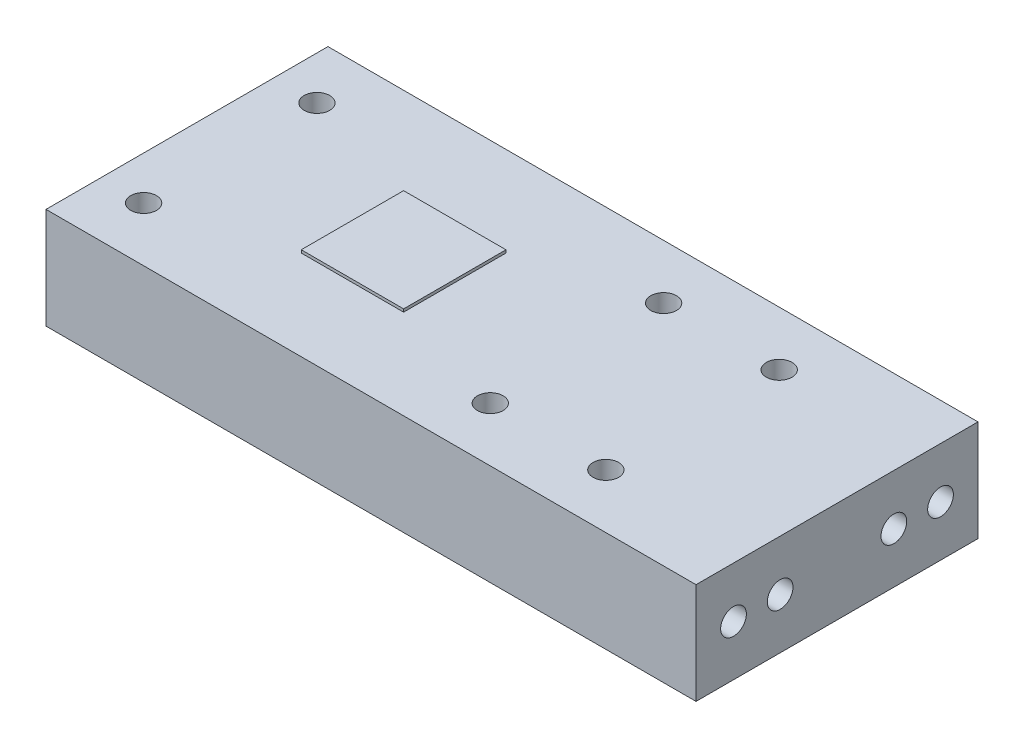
from build123d import *

# Parameters (mm, degrees)
SKETCH1_W                 = 57.15
SKETCH1_H                 = 8.89
BOSS_EXTRUDE1_DEPTH       = 24.7904
SKETCH2_W                 = 9
SKETCH2_H                 = 9
BOSS_EXTRUDE2_DEPTH       = 0.25
F_4_40_TAPPED_HOLE1_D     = 2.2606
F_4_40_TAPPED_HOLE1_DEPTH = 7.62
F_4_40_TAPPED_HOLE1_TIP   = 0.679152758
F_4_40_TAPPED_HOLE2_D     = 2.2606
F_4_40_TAPPED_HOLE2_DEPTH = 8.89
F_4_40_TAPPED_HOLE2_TIP   = 0.679152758
F_4_40_TAPPED_HOLE3_D     = 2.2606
F_4_40_TAPPED_HOLE4_D     = 2.2606
F_4_40_TAPPED_HOLE4_DEPTH = 7.62
F_4_40_TAPPED_HOLE4_TIP   = 0.679152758


with BuildPart() as part:
    # Sketch1 → Boss-Extrude1 (new body)
    with BuildSketch(Plane.XY):
        with Locations((28.575, 4.445)):
            Rectangle(SKETCH1_W, SKETCH1_H)
    extrude(amount=BOSS_EXTRUDE1_DEPTH)

    # Sketch2 → Boss-Extrude2 (add)
    with BuildSketch(Plane(origin=(0, 8.89, 0), x_dir=(1, 0, 0), z_dir=(0, 1, 0))):
        with Locations((19.0462, -12.3952)):
            Rectangle(SKETCH2_W, SKETCH2_H)
    extrude(amount=BOSS_EXTRUDE2_DEPTH)

    # 4-40 Tapped Hole1
    with Locations(Plane.ZY):
        with Locations((12.3952, 4.445)):
            Hole(F_4_40_TAPPED_HOLE1_D / 2, depth=F_4_40_TAPPED_HOLE1_DEPTH)
            with Locations((0, 0, -(F_4_40_TAPPED_HOLE1_DEPTH + F_4_40_TAPPED_HOLE1_TIP / 2))):  # 118° drill point
                Cone(0, F_4_40_TAPPED_HOLE1_D / 2, F_4_40_TAPPED_HOLE1_TIP, mode=Mode.SUBTRACT)

    # 4-40 Tapped Hole2
    with Locations(Plane(origin=(0, 8.89, 0), x_dir=(1, 0, 0), z_dir=(0, 1, 0))):
        with Locations((3.8062, -4.7752), (34.2862, -4.7752), (34.2862, -20.0152), (3.8062, -20.0152), (-6.3538, -20.0152), (-6.3538, -4.7752)):
            Hole(F_4_40_TAPPED_HOLE2_D / 2, depth=F_4_40_TAPPED_HOLE2_DEPTH)
            with Locations((0, 0, -(F_4_40_TAPPED_HOLE2_DEPTH + F_4_40_TAPPED_HOLE2_TIP / 2))):  # 118° drill point
                Cone(0, F_4_40_TAPPED_HOLE2_D / 2, F_4_40_TAPPED_HOLE2_TIP, mode=Mode.SUBTRACT)

    # 4-40 Tapped Hole3 (through all)
    with Locations(Plane(origin=(0, 8.89, 0), x_dir=(1, 0, 0), z_dir=(0, 1, 0))):
        with Locations((44.4462, -20.0152), (44.4462, -4.7752)):
            Hole(F_4_40_TAPPED_HOLE3_D / 2)

    # 4-40 Tapped Hole4
    with Locations(Plane(origin=(57.15, 0, 0), x_dir=(0, 0, -1), z_dir=(1, 0, 0))):
        with Locations((-17.3952, 4.445), (-7.3952, 4.445), (-21.4952, 4.445), (-3.2952, 4.445)):
            Hole(F_4_40_TAPPED_HOLE4_D / 2, depth=F_4_40_TAPPED_HOLE4_DEPTH)
            with Locations((0, 0, -(F_4_40_TAPPED_HOLE4_DEPTH + F_4_40_TAPPED_HOLE4_TIP / 2))):  # 118° drill point
                Cone(0, F_4_40_TAPPED_HOLE4_D / 2, F_4_40_TAPPED_HOLE4_TIP, mode=Mode.SUBTRACT)


solid = part.part
